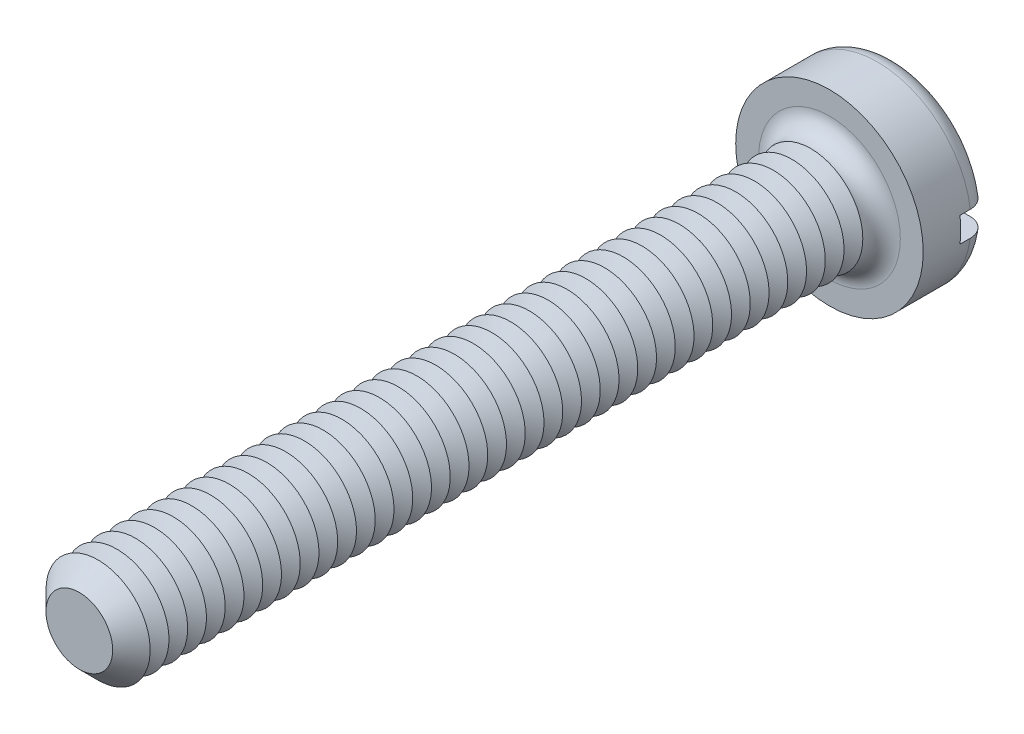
from build123d import *

# Parameters (mm, degrees)
SKETCH3_R           = 2.25
BOSS_EXTRUDE2_DEPTH = 1.6
SKETCH4_R           = 1.25
BOSS_EXTRUDE3_DEPTH = 18
FILLET1_R           = 0.45
CHAMFER1_SIZE       = 0.45
LPATTERN1_COUNT     = 38
LPATTERN1_PITCH     = 0.45
SKETCH8_W           = 4.5
SKETCH8_H           = 0.6
CUT_EXTRUDE1_DEPTH  = 0.7


with BuildPart() as part:
    # Sketch3 → Boss-Extrude2 (new body)
    with BuildSketch(Plane.XY):
        Circle(SKETCH3_R)
    extrude(amount=-BOSS_EXTRUDE2_DEPTH)

    # Sketch4 → Boss-Extrude3 (add)
    with BuildSketch(Plane.XY):
        Circle(SKETCH4_R)
    extrude(amount=BOSS_EXTRUDE3_DEPTH)

    # Fillet1
    fillet1_edges = [part.edges().sort_by_distance(p)[0] for p in [
        (-2.25, 0, -1.6),
        (-1.25, 0, 0),
    ]]
    fillet(fillet1_edges, radius=FILLET1_R)

    # Chamfer1
    chamfer1_edges = [part.edges().sort_by_distance(p)[0] for p in [
        (-1.25, 0, 18),
    ]]
    chamfer(chamfer1_edges, length=CHAMFER1_SIZE)

    # Sketch6 → Cut-Revolve1 (revolve, cut)
    with BuildSketch(Plane(origin=(0, 0, 0), x_dir=(0, 0, -1), z_dir=(1, 0, 0)), mode=Mode.PRIVATE) as cut_revolve1_sk:
        Polygon((-0.45, 1.25), (-0.675, 0.860288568), (-0.9, 1.25), align=None)
    cut_revolve1 = revolve(cut_revolve1_sk.sketch.rotate(Axis((0, 0, -1.694361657), (0, 0, 1)), 90), axis=Axis((0, 0, -1.694361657), (0, 0, 1)), mode=Mode.SUBTRACT)

    # LPattern1: Cut-Revolve1 ×38
    with Locations(*[(0, 0, i * LPATTERN1_PITCH) for i in range(1, LPATTERN1_COUNT)]):
        add(cut_revolve1, mode=Mode.SUBTRACT)

    # Sketch8 → Cut-Extrude1 (cut)
    with BuildSketch(Plane(origin=(0, 0, -1.6), x_dir=(-1, 0, 0), z_dir=(0, 0, -1))):
        Rectangle(SKETCH8_W, SKETCH8_H)
    extrude(amount=-CUT_EXTRUDE1_DEPTH, mode=Mode.SUBTRACT)


solid = part.part
